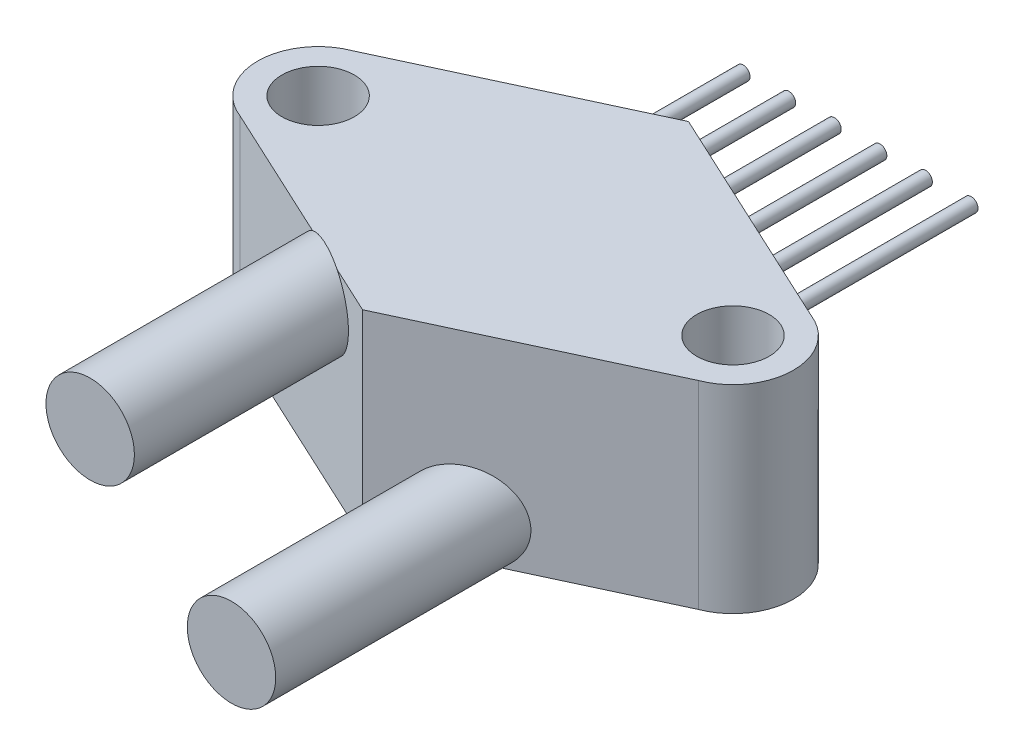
ISO-10303-21;
HEADER;
FILE_DESCRIPTION(('STEP AP214'),'2;1');
FILE_NAME('part.step','',(''),(''),'','','');
FILE_SCHEMA(('AUTOMOTIVE_DESIGN { 1 0 10303 214 1 1 1 1 }'));
ENDSEC;
DATA;
#1=APPLICATION_CONTEXT('core data for automotive mechanical design processes');
#2=APPLICATION_PROTOCOL_DEFINITION('international standard','automotive_design',2000,#1);
#3=PRODUCT_CONTEXT('',#1,'mechanical');
#4=PRODUCT('Part','Part','',(#3));
#5=PRODUCT_RELATED_PRODUCT_CATEGORY('part','',(#4));
#6=PRODUCT_DEFINITION_FORMATION('','',#4);
#7=PRODUCT_DEFINITION_CONTEXT('part definition',#1,'design');
#8=PRODUCT_DEFINITION('design','',#6,#7);
#9=PRODUCT_DEFINITION_SHAPE('','',#8);
#10=(LENGTH_UNIT() NAMED_UNIT(*) SI_UNIT(.MILLI.,.METRE.));
#11=(NAMED_UNIT(*) PLANE_ANGLE_UNIT() SI_UNIT($,.RADIAN.));
#12=(NAMED_UNIT(*) SI_UNIT($,.STERADIAN.) SOLID_ANGLE_UNIT());
#13=UNCERTAINTY_MEASURE_WITH_UNIT(LENGTH_MEASURE(1.E-05),#10,'distance_accuracy_value','');
#14=(GEOMETRIC_REPRESENTATION_CONTEXT(3) GLOBAL_UNCERTAINTY_ASSIGNED_CONTEXT((#13)) GLOBAL_UNIT_ASSIGNED_CONTEXT((#10,
#11,#12)) REPRESENTATION_CONTEXT('',''));
#15=CARTESIAN_POINT('',(0.,0.,0.));
#16=DIRECTION('',(0.,0.,1.));
#17=DIRECTION('',(1.,0.,0.));
#18=AXIS2_PLACEMENT_3D('',#15,#16,#17);
#19=CARTESIAN_POINT('',(0.,11.049,-9.0805));
#20=DIRECTION('',(-0.421848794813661,0.,0.906666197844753));
#21=DIRECTION('',(0.906666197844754,0.,0.421848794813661));
#22=AXIS2_PLACEMENT_3D('',#19,#20,#21);
#23=PLANE('',#22);
#24=CARTESIAN_POINT('',(3.81,5.5245,-7.30780359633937));
#25=DIRECTION('',(-0.421848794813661,0.,0.906666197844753));
#26=DIRECTION('',(-0.906666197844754,0.,-0.421848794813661));
#27=AXIS2_PLACEMENT_3D('',#24,#25,#26);
#28=ELLIPSE('',#27,0.420220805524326,0.381000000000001);
#29=CARTESIAN_POINT('',(3.429,5.5245,-7.48507323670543));
#30=VERTEX_POINT('',#29);
#31=EDGE_CURVE('E37',#30,#30,#28,.F.);
#32=ORIENTED_EDGE('',*,*,#31,.F.);
#33=EDGE_LOOP('',(#32));
#34=FACE_BOUND('',#33,.T.);
#35=DIRECTION('',(-0.906666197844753,0.,-0.421848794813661));
#36=VECTOR('',#35,1.);
#37=CARTESIAN_POINT('',(0.,0.,-9.0805));
#38=LINE('',#37,#36);
#39=CARTESIAN_POINT('',(12.7654847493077,0.,-3.14104359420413));
#40=VERTEX_POINT('',#39);
#41=CARTESIAN_POINT('',(0.,0.,-9.0805));
#42=VERTEX_POINT('',#41);
#43=EDGE_CURVE('E145',#40,#42,#38,.T.);
#44=ORIENTED_EDGE('',*,*,#43,.T.);
#45=DIRECTION('',(0.,-1.,0.));
#46=VECTOR('',#45,1.);
#47=CARTESIAN_POINT('',(0.,11.049,-9.0805));
#48=LINE('',#47,#46);
#49=CARTESIAN_POINT('',(0.,11.049,-9.0805));
#50=VERTEX_POINT('',#49);
#51=EDGE_CURVE('E182',#50,#42,#48,.T.);
#52=ORIENTED_EDGE('',*,*,#51,.F.);
#53=DIRECTION('',(-0.906666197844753,0.,-0.421848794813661));
#54=VECTOR('',#53,1.);
#55=CARTESIAN_POINT('',(0.,11.049,-9.0805));
#56=LINE('',#55,#54);
#57=CARTESIAN_POINT('',(12.7654847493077,11.049,-3.14104359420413));
#58=VERTEX_POINT('',#57);
#59=EDGE_CURVE('E160',#58,#50,#56,.T.);
#60=ORIENTED_EDGE('',*,*,#59,.F.);
#61=DIRECTION('',(0.,-1.,0.));
#62=VECTOR('',#61,1.);
#63=CARTESIAN_POINT('',(12.7654847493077,11.049,-3.14104359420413));
#64=LINE('',#63,#62);
#65=EDGE_CURVE('E169',#58,#40,#64,.T.);
#66=ORIENTED_EDGE('',*,*,#65,.T.);
#67=EDGE_LOOP('',(#44,#52,#60,#66));
#68=FACE_BOUND('',#67,.T.);
#69=CARTESIAN_POINT('',(6.35,5.5245,-6.12600599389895));
#70=DIRECTION('',(-0.421848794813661,0.,0.906666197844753));
#71=DIRECTION('',(-0.906666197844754,0.,-0.421848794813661));
#72=AXIS2_PLACEMENT_3D('',#69,#70,#71);
#73=ELLIPSE('',#72,0.420220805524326,0.381000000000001);
#74=CARTESIAN_POINT('',(5.969,5.5245,-6.30327563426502));
#75=VERTEX_POINT('',#74);
#76=EDGE_CURVE('E194',#75,#75,#73,.F.);
#77=ORIENTED_EDGE('',*,*,#76,.F.);
#78=EDGE_LOOP('',(#77));
#79=FACE_BOUND('',#78,.T.);
#80=CARTESIAN_POINT('',(1.27,5.5245,-8.48960119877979));
#81=DIRECTION('',(-0.421848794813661,0.,0.906666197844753));
#82=DIRECTION('',(-0.906666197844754,0.,-0.421848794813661));
#83=AXIS2_PLACEMENT_3D('',#80,#81,#82);
#84=ELLIPSE('',#83,0.420220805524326,0.381);
#85=CARTESIAN_POINT('',(0.889000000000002,5.5245,-8.66687083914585));
#86=VERTEX_POINT('',#85);
#87=EDGE_CURVE('E11',#86,#86,#84,.F.);
#88=ORIENTED_EDGE('',*,*,#87,.F.);
#89=EDGE_LOOP('',(#88));
#90=FACE_BOUND('',#89,.T.);
#91=ADVANCED_FACE('F30',(#34,#68,#79,#90),#23,.F.);
#92=CARTESIAN_POINT('',(0.,11.049,-9.0805));
#93=DIRECTION('',(0.421848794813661,0.,0.906666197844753));
#94=DIRECTION('',(0.906666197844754,0.,-0.421848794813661));
#95=AXIS2_PLACEMENT_3D('',#92,#93,#94);
#96=PLANE('',#95);
#97=CARTESIAN_POINT('',(-3.81,5.5245,-7.30780359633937));
#98=DIRECTION('',(0.421848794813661,0.,0.906666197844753));
#99=DIRECTION('',(0.906666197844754,0.,-0.421848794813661));
#100=AXIS2_PLACEMENT_3D('',#97,#98,#99);
#101=ELLIPSE('',#100,0.420220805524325,0.381);
#102=CARTESIAN_POINT('',(-3.429,5.5245,-7.48507323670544));
#103=VERTEX_POINT('',#102);
#104=EDGE_CURVE('E188',#103,#103,#101,.F.);
#105=ORIENTED_EDGE('',*,*,#104,.F.);
#106=EDGE_LOOP('',(#105));
#107=FACE_BOUND('',#106,.T.);
#108=DIRECTION('',(-0.906666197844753,0.,0.421848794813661));
#109=VECTOR('',#108,1.);
#110=CARTESIAN_POINT('',(0.,0.,-9.0805));
#111=LINE('',#110,#109);
#112=CARTESIAN_POINT('',(-12.7654847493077,0.,-3.14104359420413));
#113=VERTEX_POINT('',#112);
#114=EDGE_CURVE('E148',#42,#113,#111,.T.);
#115=ORIENTED_EDGE('',*,*,#114,.T.);
#116=DIRECTION('',(0.,-1.,0.));
#117=VECTOR('',#116,1.);
#118=CARTESIAN_POINT('',(-12.7654847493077,11.049,-3.14104359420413));
#119=LINE('',#118,#117);
#120=CARTESIAN_POINT('',(-12.7654847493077,11.049,-3.14104359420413));
#121=VERTEX_POINT('',#120);
#122=EDGE_CURVE('E179',#121,#113,#119,.T.);
#123=ORIENTED_EDGE('',*,*,#122,.F.);
#124=DIRECTION('',(-0.906666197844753,0.,0.421848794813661));
#125=VECTOR('',#124,1.);
#126=CARTESIAN_POINT('',(0.,11.049,-9.0805));
#127=LINE('',#126,#125);
#128=EDGE_CURVE('E162',#50,#121,#127,.T.);
#129=ORIENTED_EDGE('',*,*,#128,.F.);
#130=ORIENTED_EDGE('',*,*,#51,.T.);
#131=EDGE_LOOP('',(#115,#123,#129,#130));
#132=FACE_BOUND('',#131,.T.);
#133=CARTESIAN_POINT('',(-1.27,5.5245,-8.48960119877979));
#134=DIRECTION('',(0.421848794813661,0.,0.906666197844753));
#135=DIRECTION('',(0.906666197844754,0.,-0.421848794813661));
#136=AXIS2_PLACEMENT_3D('',#133,#134,#135);
#137=ELLIPSE('',#136,0.420220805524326,0.381);
#138=CARTESIAN_POINT('',(-0.889,5.5245,-8.66687083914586));
#139=VERTEX_POINT('',#138);
#140=EDGE_CURVE('E114',#139,#139,#137,.F.);
#141=ORIENTED_EDGE('',*,*,#140,.F.);
#142=EDGE_LOOP('',(#141));
#143=FACE_BOUND('',#142,.T.);
#144=CARTESIAN_POINT('',(-6.35,5.5245,-6.12600599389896));
#145=DIRECTION('',(0.421848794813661,0.,0.906666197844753));
#146=DIRECTION('',(0.906666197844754,0.,-0.421848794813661));
#147=AXIS2_PLACEMENT_3D('',#144,#145,#146);
#148=ELLIPSE('',#147,0.420220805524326,0.381000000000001);
#149=CARTESIAN_POINT('',(-5.969,5.5245,-6.30327563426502));
#150=VERTEX_POINT('',#149);
#151=EDGE_CURVE('E191',#150,#150,#148,.F.);
#152=ORIENTED_EDGE('',*,*,#151,.F.);
#153=EDGE_LOOP('',(#152));
#154=FACE_BOUND('',#153,.T.);
#155=ADVANCED_FACE('F203',(#107,#132,#143,#154),#96,.F.);
#156=CARTESIAN_POINT('',(0.,11.049,9.0805));
#157=DIRECTION('',(0.421848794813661,0.,-0.906666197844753));
#158=DIRECTION('',(-0.906666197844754,0.,-0.421848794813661));
#159=AXIS2_PLACEMENT_3D('',#156,#157,#158);
#160=PLANE('',#159);
#161=CARTESIAN_POINT('',(-3.937,8.9408,7.24871371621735));
#162=DIRECTION('',(0.421848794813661,0.,-0.906666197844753));
#163=DIRECTION('',(-0.906666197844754,0.,-0.421848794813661));
#164=AXIS2_PLACEMENT_3D('',#161,#162,#163);
#165=ELLIPSE('',#164,2.71742787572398,2.4638);
#166=CARTESIAN_POINT('',(-5.21206988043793,11.049,6.65545602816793));
#167=VERTEX_POINT('',#166);
#168=CARTESIAN_POINT('',(-2.66193011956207,11.049,7.84197140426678));
#169=VERTEX_POINT('',#168);
#170=EDGE_CURVE('E44',#167,#169,#165,.F.);
#171=ORIENTED_EDGE('',*,*,#170,.F.);
#172=DIRECTION('',(0.906666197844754,0.,0.421848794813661));
#173=VECTOR('',#172,1.);
#174=CARTESIAN_POINT('',(0.,11.049,9.0805));
#175=LINE('',#174,#173);
#176=CARTESIAN_POINT('',(-12.7654847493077,11.049,3.14104359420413));
#177=VERTEX_POINT('',#176);
#178=EDGE_CURVE('E101',#177,#167,#175,.T.);
#179=ORIENTED_EDGE('',*,*,#178,.F.);
#180=DIRECTION('',(0.,-1.,0.));
#181=VECTOR('',#180,1.);
#182=CARTESIAN_POINT('',(-12.7654847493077,11.049,3.14104359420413));
#183=LINE('',#182,#181);
#184=CARTESIAN_POINT('',(-12.7654847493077,0.,3.14104359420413));
#185=VERTEX_POINT('',#184);
#186=EDGE_CURVE('E176',#177,#185,#183,.T.);
#187=ORIENTED_EDGE('',*,*,#186,.T.);
#188=DIRECTION('',(0.906666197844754,0.,0.421848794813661));
#189=VECTOR('',#188,1.);
#190=CARTESIAN_POINT('',(0.,0.,9.0805));
#191=LINE('',#190,#189);
#192=CARTESIAN_POINT('',(0.,0.,9.0805));
#193=VERTEX_POINT('',#192);
#194=EDGE_CURVE('E152',#185,#193,#191,.T.);
#195=ORIENTED_EDGE('',*,*,#194,.T.);
#196=DIRECTION('',(0.,-1.,0.));
#197=VECTOR('',#196,1.);
#198=CARTESIAN_POINT('',(0.,11.049,9.0805));
#199=LINE('',#198,#197);
#200=CARTESIAN_POINT('',(0.,11.049,9.0805));
#201=VERTEX_POINT('',#200);
#202=EDGE_CURVE('E108',#201,#193,#199,.T.);
#203=ORIENTED_EDGE('',*,*,#202,.F.);
#204=EDGE_CURVE('E99',#169,#201,#175,.T.);
#205=ORIENTED_EDGE('',*,*,#204,.F.);
#206=EDGE_LOOP('',(#171,#179,#187,#195,#203,#205));
#207=FACE_BOUND('',#206,.T.);
#208=ADVANCED_FACE('F106',(#207),#160,.F.);
#209=CARTESIAN_POINT('',(0.,11.049,9.0805));
#210=DIRECTION('',(-0.421848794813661,0.,-0.906666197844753));
#211=DIRECTION('',(-0.906666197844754,0.,0.421848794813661));
#212=AXIS2_PLACEMENT_3D('',#209,#210,#211);
#213=PLANE('',#212);
#214=CARTESIAN_POINT('',(3.937,2.1082,7.24871371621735));
#215=DIRECTION('',(-0.421848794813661,0.,-0.906666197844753));
#216=DIRECTION('',(0.906666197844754,0.,-0.421848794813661));
#217=AXIS2_PLACEMENT_3D('',#214,#215,#216);
#218=ELLIPSE('',#217,2.71742787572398,2.4638);
#219=CARTESIAN_POINT('',(5.21206988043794,0.,6.65545602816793));
#220=VERTEX_POINT('',#219);
#221=CARTESIAN_POINT('',(2.66193011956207,0.,7.84197140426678));
#222=VERTEX_POINT('',#221);
#223=EDGE_CURVE('E52',#220,#222,#218,.F.);
#224=ORIENTED_EDGE('',*,*,#223,.F.);
#225=DIRECTION('',(0.906666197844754,0.,-0.421848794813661));
#226=VECTOR('',#225,1.);
#227=CARTESIAN_POINT('',(0.,0.,9.0805));
#228=LINE('',#227,#226);
#229=CARTESIAN_POINT('',(12.7654847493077,0.,3.14104359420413));
#230=VERTEX_POINT('',#229);
#231=EDGE_CURVE('E154',#220,#230,#228,.T.);
#232=ORIENTED_EDGE('',*,*,#231,.T.);
#233=DIRECTION('',(0.,-1.,0.));
#234=VECTOR('',#233,1.);
#235=CARTESIAN_POINT('',(12.7654847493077,11.049,3.14104359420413));
#236=LINE('',#235,#234);
#237=CARTESIAN_POINT('',(12.7654847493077,11.049,3.14104359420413));
#238=VERTEX_POINT('',#237);
#239=EDGE_CURVE('E172',#238,#230,#236,.T.);
#240=ORIENTED_EDGE('',*,*,#239,.F.);
#241=DIRECTION('',(0.906666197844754,0.,-0.421848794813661));
#242=VECTOR('',#241,1.);
#243=CARTESIAN_POINT('',(0.,11.049,9.0805));
#244=LINE('',#243,#242);
#245=EDGE_CURVE('E165',#201,#238,#244,.T.);
#246=ORIENTED_EDGE('',*,*,#245,.F.);
#247=ORIENTED_EDGE('',*,*,#202,.T.);
#248=EDGE_CURVE('E155',#193,#222,#228,.T.);
#249=ORIENTED_EDGE('',*,*,#248,.T.);
#250=EDGE_LOOP('',(#224,#232,#240,#246,#247,#249));
#251=FACE_BOUND('',#250,.T.);
#252=ADVANCED_FACE('F299',(#251),#213,.F.);
#253=CARTESIAN_POINT('',(11.557,11.049,0.));
#254=DIRECTION('',(0.,1.,0.));
#255=DIRECTION('',(0.,0.,1.));
#256=AXIS2_PLACEMENT_3D('',#253,#254,#255);
#257=PLANE('',#256);
#258=CARTESIAN_POINT('',(11.557,11.049,0.));
#259=DIRECTION('',(0.,1.,0.));
#260=DIRECTION('',(0.,0.,1.));
#261=AXIS2_PLACEMENT_3D('',#258,#259,#260);
#262=CIRCLE('',#261,2.0193);
#263=CARTESIAN_POINT('',(11.557,11.049,2.0193));
#264=VERTEX_POINT('',#263);
#265=EDGE_CURVE('E142',#264,#264,#262,.T.);
#266=ORIENTED_EDGE('',*,*,#265,.F.);
#267=EDGE_LOOP('',(#266));
#268=FACE_BOUND('',#267,.T.);
#269=ORIENTED_EDGE('',*,*,#59,.T.);
#270=ORIENTED_EDGE('',*,*,#128,.T.);
#271=CARTESIAN_POINT('',(-11.557,11.049,0.));
#272=DIRECTION('',(0.,1.,0.));
#273=DIRECTION('',(0.,0.,-1.));
#274=AXIS2_PLACEMENT_3D('',#271,#272,#273);
#275=CIRCLE('',#274,3.3655);
#276=EDGE_CURVE('E110',#121,#177,#275,.T.);
#277=ORIENTED_EDGE('',*,*,#276,.T.);
#278=ORIENTED_EDGE('',*,*,#178,.T.);
#279=EDGE_CURVE('E95',#167,#169,#175,.T.);
#280=ORIENTED_EDGE('',*,*,#279,.T.);
#281=ORIENTED_EDGE('',*,*,#204,.T.);
#282=ORIENTED_EDGE('',*,*,#245,.T.);
#283=CARTESIAN_POINT('',(11.557,11.049,0.));
#284=DIRECTION('',(0.,1.,0.));
#285=DIRECTION('',(0.,0.,1.));
#286=AXIS2_PLACEMENT_3D('',#283,#284,#285);
#287=CIRCLE('',#286,3.3655);
#288=EDGE_CURVE('E167',#238,#58,#287,.T.);
#289=ORIENTED_EDGE('',*,*,#288,.T.);
#290=EDGE_LOOP('',(#269,#270,#277,#278,#280,#281,#282,#289));
#291=FACE_BOUND('',#290,.T.);
#292=CARTESIAN_POINT('',(-11.557,11.049,0.));
#293=DIRECTION('',(0.,1.,0.));
#294=DIRECTION('',(0.,0.,-1.));
#295=AXIS2_PLACEMENT_3D('',#292,#293,#294);
#296=CIRCLE('',#295,2.0193);
#297=CARTESIAN_POINT('',(-11.557,11.049,-2.0193));
#298=VERTEX_POINT('',#297);
#299=EDGE_CURVE('E136',#298,#298,#296,.T.);
#300=ORIENTED_EDGE('',*,*,#299,.F.);
#301=EDGE_LOOP('',(#300));
#302=FACE_BOUND('',#301,.T.);
#303=ADVANCED_FACE('F97',(#268,#291,#302),#257,.T.);
#304=CARTESIAN_POINT('',(11.557,0.,0.));
#305=DIRECTION('',(0.,1.,0.));
#306=DIRECTION('',(0.,0.,1.));
#307=AXIS2_PLACEMENT_3D('',#304,#305,#306);
#308=PLANE('',#307);
#309=CARTESIAN_POINT('',(11.557,0.,0.));
#310=DIRECTION('',(0.,1.,0.));
#311=DIRECTION('',(0.,0.,1.));
#312=AXIS2_PLACEMENT_3D('',#309,#310,#311);
#313=CIRCLE('',#312,2.0193);
#314=CARTESIAN_POINT('',(11.557,0.,2.0193));
#315=VERTEX_POINT('',#314);
#316=EDGE_CURVE('E139',#315,#315,#313,.T.);
#317=ORIENTED_EDGE('',*,*,#316,.T.);
#318=EDGE_LOOP('',(#317));
#319=FACE_BOUND('',#318,.T.);
#320=ORIENTED_EDGE('',*,*,#43,.F.);
#321=CARTESIAN_POINT('',(11.557,0.,0.));
#322=DIRECTION('',(0.,1.,0.));
#323=DIRECTION('',(0.,0.,1.));
#324=AXIS2_PLACEMENT_3D('',#321,#322,#323);
#325=CIRCLE('',#324,3.3655);
#326=EDGE_CURVE('E157',#230,#40,#325,.T.);
#327=ORIENTED_EDGE('',*,*,#326,.F.);
#328=ORIENTED_EDGE('',*,*,#231,.F.);
#329=EDGE_CURVE('E158',#222,#220,#228,.T.);
#330=ORIENTED_EDGE('',*,*,#329,.F.);
#331=ORIENTED_EDGE('',*,*,#248,.F.);
#332=ORIENTED_EDGE('',*,*,#194,.F.);
#333=CARTESIAN_POINT('',(-11.557,0.,0.));
#334=DIRECTION('',(0.,1.,0.));
#335=DIRECTION('',(0.,0.,-1.));
#336=AXIS2_PLACEMENT_3D('',#333,#334,#335);
#337=CIRCLE('',#336,3.3655);
#338=EDGE_CURVE('E150',#113,#185,#337,.T.);
#339=ORIENTED_EDGE('',*,*,#338,.F.);
#340=ORIENTED_EDGE('',*,*,#114,.F.);
#341=EDGE_LOOP('',(#320,#327,#328,#330,#331,#332,#339,#340));
#342=FACE_BOUND('',#341,.T.);
#343=CARTESIAN_POINT('',(-11.557,0.,0.));
#344=DIRECTION('',(0.,1.,0.));
#345=DIRECTION('',(0.,0.,-1.));
#346=AXIS2_PLACEMENT_3D('',#343,#344,#345);
#347=CIRCLE('',#346,2.0193);
#348=CARTESIAN_POINT('',(-11.557,0.,-2.0193));
#349=VERTEX_POINT('',#348);
#350=EDGE_CURVE('E133',#349,#349,#347,.T.);
#351=ORIENTED_EDGE('',*,*,#350,.T.);
#352=EDGE_LOOP('',(#351));
#353=FACE_BOUND('',#352,.T.);
#354=ADVANCED_FACE('F292',(#319,#342,#353),#308,.F.);
#355=CARTESIAN_POINT('',(-11.557,11.049,0.));
#356=DIRECTION('',(0.,-1.,0.));
#357=DIRECTION('',(0.,0.,-1.));
#358=AXIS2_PLACEMENT_3D('',#355,#356,#357);
#359=CYLINDRICAL_SURFACE('',#358,3.3655);
#360=ORIENTED_EDGE('',*,*,#338,.T.);
#361=ORIENTED_EDGE('',*,*,#186,.F.);
#362=ORIENTED_EDGE('',*,*,#276,.F.);
#363=ORIENTED_EDGE('',*,*,#122,.T.);
#364=EDGE_LOOP('',(#360,#361,#362,#363));
#365=FACE_BOUND('',#364,.T.);
#366=ADVANCED_FACE('F295',(#365),#359,.T.);
#367=CARTESIAN_POINT('',(11.557,11.049,0.));
#368=DIRECTION('',(0.,-1.,0.));
#369=DIRECTION('',(0.,0.,-1.));
#370=AXIS2_PLACEMENT_3D('',#367,#368,#369);
#371=CYLINDRICAL_SURFACE('',#370,3.3655);
#372=ORIENTED_EDGE('',*,*,#326,.T.);
#373=ORIENTED_EDGE('',*,*,#65,.F.);
#374=ORIENTED_EDGE('',*,*,#288,.F.);
#375=ORIENTED_EDGE('',*,*,#239,.T.);
#376=EDGE_LOOP('',(#372,#373,#374,#375));
#377=FACE_BOUND('',#376,.T.);
#378=ADVANCED_FACE('F290',(#377),#371,.T.);
#379=CARTESIAN_POINT('',(11.557,11.049,0.));
#380=DIRECTION('',(0.,-1.,0.));
#381=DIRECTION('',(0.,0.,-1.));
#382=AXIS2_PLACEMENT_3D('',#379,#380,#381);
#383=CYLINDRICAL_SURFACE('',#382,2.0193);
#384=ORIENTED_EDGE('',*,*,#265,.T.);
#385=EDGE_LOOP('',(#384));
#386=FACE_BOUND('',#385,.T.);
#387=ORIENTED_EDGE('',*,*,#316,.F.);
#388=EDGE_LOOP('',(#387));
#389=FACE_BOUND('',#388,.T.);
#390=ADVANCED_FACE('F286',(#386,#389),#383,.F.);
#391=CARTESIAN_POINT('',(-11.557,11.049,0.));
#392=DIRECTION('',(0.,-1.,0.));
#393=DIRECTION('',(0.,0.,-1.));
#394=AXIS2_PLACEMENT_3D('',#391,#392,#393);
#395=CYLINDRICAL_SURFACE('',#394,2.0193);
#396=ORIENTED_EDGE('',*,*,#299,.T.);
#397=EDGE_LOOP('',(#396));
#398=FACE_BOUND('',#397,.T.);
#399=ORIENTED_EDGE('',*,*,#350,.F.);
#400=EDGE_LOOP('',(#399));
#401=FACE_BOUND('',#400,.T.);
#402=ADVANCED_FACE('F276',(#398,#401),#395,.F.);
#403=CARTESIAN_POINT('',(0.,11.049,9.0805));
#404=DIRECTION('',(-0.421848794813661,0.,-0.906666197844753));
#405=DIRECTION('',(-0.906666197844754,0.,0.421848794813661));
#406=AXIS2_PLACEMENT_3D('',#403,#404,#405);
#407=PLANE('',#406);
#408=ORIENTED_EDGE('',*,*,#329,.T.);
#409=CARTESIAN_POINT('',(3.937,2.1082,7.24871371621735));
#410=DIRECTION('',(-0.421848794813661,0.,-0.906666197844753));
#411=DIRECTION('',(-0.906666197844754,0.,0.421848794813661));
#412=AXIS2_PLACEMENT_3D('',#409,#410,#411);
#413=ELLIPSE('',#412,2.71742787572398,2.4638);
#414=EDGE_CURVE('E121',#222,#220,#413,.F.);
#415=ORIENTED_EDGE('',*,*,#414,.F.);
#416=EDGE_LOOP('',(#408,#415));
#417=FACE_BOUND('',#416,.T.);
#418=ADVANCED_FACE('F272',(#417),#407,.T.);
#419=CARTESIAN_POINT('',(3.937,2.1082,20.32));
#420=DIRECTION('',(0.,0.,-1.));
#421=DIRECTION('',(-1.,0.,0.));
#422=AXIS2_PLACEMENT_3D('',#419,#420,#421);
#423=CYLINDRICAL_SURFACE('',#422,2.4638);
#424=CARTESIAN_POINT('',(3.937,2.1082,20.32));
#425=DIRECTION('',(0.,0.,1.));
#426=DIRECTION('',(1.,0.,0.));
#427=AXIS2_PLACEMENT_3D('',#424,#425,#426);
#428=CIRCLE('',#427,2.4638);
#429=CARTESIAN_POINT('',(6.4008,2.1082,20.32));
#430=VERTEX_POINT('',#429);
#431=EDGE_CURVE('E130',#430,#430,#428,.T.);
#432=ORIENTED_EDGE('',*,*,#431,.F.);
#433=EDGE_LOOP('',(#432));
#434=FACE_BOUND('',#433,.T.);
#435=ORIENTED_EDGE('',*,*,#414,.T.);
#436=ORIENTED_EDGE('',*,*,#223,.T.);
#437=EDGE_LOOP('',(#435,#436));
#438=FACE_BOUND('',#437,.T.);
#439=ADVANCED_FACE('F275',(#434,#438),#423,.T.);
#440=CARTESIAN_POINT('',(3.937,2.1082,20.32));
#441=DIRECTION('',(0.,0.,1.));
#442=DIRECTION('',(1.,0.,0.));
#443=AXIS2_PLACEMENT_3D('',#440,#441,#442);
#444=PLANE('',#443);
#445=ORIENTED_EDGE('',*,*,#431,.T.);
#446=EDGE_LOOP('',(#445));
#447=FACE_BOUND('',#446,.T.);
#448=ADVANCED_FACE('F270',(#447),#444,.T.);
#449=CARTESIAN_POINT('',(-3.937,8.9408,20.32));
#450=DIRECTION('',(0.,0.,-1.));
#451=DIRECTION('',(-1.,0.,0.));
#452=AXIS2_PLACEMENT_3D('',#449,#450,#451);
#453=CYLINDRICAL_SURFACE('',#452,2.4638);
#454=CARTESIAN_POINT('',(-3.937,8.9408,20.32));
#455=DIRECTION('',(0.,0.,1.));
#456=DIRECTION('',(1.,0.,0.));
#457=AXIS2_PLACEMENT_3D('',#454,#455,#456);
#458=CIRCLE('',#457,2.4638);
#459=CARTESIAN_POINT('',(-1.4732,8.9408,20.32));
#460=VERTEX_POINT('',#459);
#461=EDGE_CURVE('E117',#460,#460,#458,.T.);
#462=ORIENTED_EDGE('',*,*,#461,.F.);
#463=EDGE_LOOP('',(#462));
#464=FACE_BOUND('',#463,.T.);
#465=CARTESIAN_POINT('',(-3.937,8.9408,7.24871371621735));
#466=DIRECTION('',(0.421848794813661,0.,-0.906666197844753));
#467=DIRECTION('',(0.906666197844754,0.,0.421848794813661));
#468=AXIS2_PLACEMENT_3D('',#465,#466,#467);
#469=ELLIPSE('',#468,2.71742787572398,2.4638);
#470=EDGE_CURVE('E113',#169,#167,#469,.F.);
#471=ORIENTED_EDGE('',*,*,#470,.T.);
#472=ORIENTED_EDGE('',*,*,#170,.T.);
#473=EDGE_LOOP('',(#471,#472));
#474=FACE_BOUND('',#473,.T.);
#475=ADVANCED_FACE('F112',(#464,#474),#453,.T.);
#476=CARTESIAN_POINT('',(-3.937,8.9408,20.32));
#477=DIRECTION('',(0.,0.,1.));
#478=DIRECTION('',(1.,0.,0.));
#479=AXIS2_PLACEMENT_3D('',#476,#477,#478);
#480=PLANE('',#479);
#481=ORIENTED_EDGE('',*,*,#461,.T.);
#482=EDGE_LOOP('',(#481));
#483=FACE_BOUND('',#482,.T.);
#484=ADVANCED_FACE('F264',(#483),#480,.T.);
#485=CARTESIAN_POINT('',(0.,11.049,9.0805));
#486=DIRECTION('',(0.421848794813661,0.,-0.906666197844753));
#487=DIRECTION('',(-0.906666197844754,0.,-0.421848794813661));
#488=AXIS2_PLACEMENT_3D('',#485,#486,#487);
#489=PLANE('',#488);
#490=ORIENTED_EDGE('',*,*,#470,.F.);
#491=ORIENTED_EDGE('',*,*,#279,.F.);
#492=EDGE_LOOP('',(#490,#491));
#493=FACE_BOUND('',#492,.T.);
#494=ADVANCED_FACE('F116',(#493),#489,.T.);
#495=CARTESIAN_POINT('',(-1.27,5.5245,2.032));
#496=DIRECTION('',(0.,0.,-1.));
#497=DIRECTION('',(-1.,0.,0.));
#498=AXIS2_PLACEMENT_3D('',#495,#496,#497);
#499=CYLINDRICAL_SURFACE('',#498,0.381);
#500=CARTESIAN_POINT('',(-1.27,5.5245,-18.4785));
#501=DIRECTION('',(0.,0.,1.));
#502=DIRECTION('',(1.,0.,0.));
#503=AXIS2_PLACEMENT_3D('',#500,#501,#502);
#504=CIRCLE('',#503,0.381);
#505=CARTESIAN_POINT('',(-0.889,5.5245,-18.4785));
#506=VERTEX_POINT('',#505);
#507=EDGE_CURVE('E118',#506,#506,#504,.T.);
#508=ORIENTED_EDGE('',*,*,#507,.T.);
#509=EDGE_LOOP('',(#508));
#510=FACE_BOUND('',#509,.T.);
#511=ORIENTED_EDGE('',*,*,#140,.T.);
#512=EDGE_LOOP('',(#511));
#513=FACE_BOUND('',#512,.T.);
#514=ADVANCED_FACE('F257',(#510,#513),#499,.T.);
#515=CARTESIAN_POINT('',(-1.27,5.5245,-18.4785));
#516=DIRECTION('',(0.,0.,1.));
#517=DIRECTION('',(1.,0.,0.));
#518=AXIS2_PLACEMENT_3D('',#515,#516,#517);
#519=PLANE('',#518);
#520=ORIENTED_EDGE('',*,*,#507,.F.);
#521=EDGE_LOOP('',(#520));
#522=FACE_BOUND('',#521,.T.);
#523=ADVANCED_FACE('F253',(#522),#519,.F.);
#524=CARTESIAN_POINT('',(-3.81,5.5245,2.032));
#525=DIRECTION('',(0.,0.,-1.));
#526=DIRECTION('',(-1.,0.,0.));
#527=AXIS2_PLACEMENT_3D('',#524,#525,#526);
#528=CYLINDRICAL_SURFACE('',#527,0.381);
#529=CARTESIAN_POINT('',(-3.81,5.5245,-18.4785));
#530=DIRECTION('',(0.,0.,1.));
#531=DIRECTION('',(1.,0.,0.));
#532=AXIS2_PLACEMENT_3D('',#529,#530,#531);
#533=CIRCLE('',#532,0.381);
#534=CARTESIAN_POINT('',(-3.429,5.5245,-18.4785));
#535=VERTEX_POINT('',#534);
#536=EDGE_CURVE('E124',#535,#535,#533,.T.);
#537=ORIENTED_EDGE('',*,*,#536,.T.);
#538=EDGE_LOOP('',(#537));
#539=FACE_BOUND('',#538,.T.);
#540=ORIENTED_EDGE('',*,*,#104,.T.);
#541=EDGE_LOOP('',(#540));
#542=FACE_BOUND('',#541,.T.);
#543=ADVANCED_FACE('F249',(#539,#542),#528,.T.);
#544=CARTESIAN_POINT('',(-3.81,5.5245,-18.4785));
#545=DIRECTION('',(0.,0.,1.));
#546=DIRECTION('',(1.,0.,0.));
#547=AXIS2_PLACEMENT_3D('',#544,#545,#546);
#548=PLANE('',#547);
#549=ORIENTED_EDGE('',*,*,#536,.F.);
#550=EDGE_LOOP('',(#549));
#551=FACE_BOUND('',#550,.T.);
#552=ADVANCED_FACE('F245',(#551),#548,.F.);
#553=CARTESIAN_POINT('',(-6.35,5.5245,2.032));
#554=DIRECTION('',(0.,0.,-1.));
#555=DIRECTION('',(-1.,0.,0.));
#556=AXIS2_PLACEMENT_3D('',#553,#554,#555);
#557=CYLINDRICAL_SURFACE('',#556,0.381000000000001);
#558=CARTESIAN_POINT('',(-6.35,5.5245,-18.4785));
#559=DIRECTION('',(0.,0.,1.));
#560=DIRECTION('',(1.,0.,0.));
#561=AXIS2_PLACEMENT_3D('',#558,#559,#560);
#562=CIRCLE('',#561,0.381000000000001);
#563=CARTESIAN_POINT('',(-5.969,5.5245,-18.4785));
#564=VERTEX_POINT('',#563);
#565=EDGE_CURVE('E515',#564,#564,#562,.T.);
#566=ORIENTED_EDGE('',*,*,#565,.T.);
#567=EDGE_LOOP('',(#566));
#568=FACE_BOUND('',#567,.T.);
#569=ORIENTED_EDGE('',*,*,#151,.T.);
#570=EDGE_LOOP('',(#569));
#571=FACE_BOUND('',#570,.T.);
#572=ADVANCED_FACE('F241',(#568,#571),#557,.T.);
#573=CARTESIAN_POINT('',(-6.35,5.5245,-18.4785));
#574=DIRECTION('',(0.,0.,1.));
#575=DIRECTION('',(1.,0.,0.));
#576=AXIS2_PLACEMENT_3D('',#573,#574,#575);
#577=PLANE('',#576);
#578=ORIENTED_EDGE('',*,*,#565,.F.);
#579=EDGE_LOOP('',(#578));
#580=FACE_BOUND('',#579,.T.);
#581=ADVANCED_FACE('F237',(#580),#577,.F.);
#582=CARTESIAN_POINT('',(6.35,5.5245,2.032));
#583=DIRECTION('',(0.,0.,-1.));
#584=DIRECTION('',(-1.,0.,0.));
#585=AXIS2_PLACEMENT_3D('',#582,#583,#584);
#586=CYLINDRICAL_SURFACE('',#585,0.381000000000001);
#587=CARTESIAN_POINT('',(6.35,5.5245,-18.4785));
#588=DIRECTION('',(0.,0.,1.));
#589=DIRECTION('',(-1.,0.,0.));
#590=AXIS2_PLACEMENT_3D('',#587,#588,#589);
#591=CIRCLE('',#590,0.381000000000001);
#592=CARTESIAN_POINT('',(5.969,5.5245,-18.4785));
#593=VERTEX_POINT('',#592);
#594=EDGE_CURVE('E517',#593,#593,#591,.T.);
#595=ORIENTED_EDGE('',*,*,#594,.T.);
#596=EDGE_LOOP('',(#595));
#597=FACE_BOUND('',#596,.T.);
#598=ORIENTED_EDGE('',*,*,#76,.T.);
#599=EDGE_LOOP('',(#598));
#600=FACE_BOUND('',#599,.T.);
#601=ADVANCED_FACE('F233',(#597,#600),#586,.T.);
#602=CARTESIAN_POINT('',(6.35,5.5245,-18.4785));
#603=DIRECTION('',(0.,0.,-1.));
#604=DIRECTION('',(-1.,0.,0.));
#605=AXIS2_PLACEMENT_3D('',#602,#603,#604);
#606=PLANE('',#605);
#607=ORIENTED_EDGE('',*,*,#594,.F.);
#608=EDGE_LOOP('',(#607));
#609=FACE_BOUND('',#608,.T.);
#610=ADVANCED_FACE('F229',(#609),#606,.T.);
#611=CARTESIAN_POINT('',(3.81,5.5245,2.032));
#612=DIRECTION('',(0.,0.,-1.));
#613=DIRECTION('',(-1.,0.,0.));
#614=AXIS2_PLACEMENT_3D('',#611,#612,#613);
#615=CYLINDRICAL_SURFACE('',#614,0.381000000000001);
#616=CARTESIAN_POINT('',(3.81,5.5245,-18.4785));
#617=DIRECTION('',(0.,0.,1.));
#618=DIRECTION('',(-1.,0.,0.));
#619=AXIS2_PLACEMENT_3D('',#616,#617,#618);
#620=CIRCLE('',#619,0.381000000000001);
#621=CARTESIAN_POINT('',(3.429,5.5245,-18.4785));
#622=VERTEX_POINT('',#621);
#623=EDGE_CURVE('E522',#622,#622,#620,.T.);
#624=ORIENTED_EDGE('',*,*,#623,.T.);
#625=EDGE_LOOP('',(#624));
#626=FACE_BOUND('',#625,.T.);
#627=ORIENTED_EDGE('',*,*,#31,.T.);
#628=EDGE_LOOP('',(#627));
#629=FACE_BOUND('',#628,.T.);
#630=ADVANCED_FACE('F199',(#626,#629),#615,.T.);
#631=CARTESIAN_POINT('',(3.81,5.5245,-18.4785));
#632=DIRECTION('',(0.,0.,-1.));
#633=DIRECTION('',(-1.,0.,0.));
#634=AXIS2_PLACEMENT_3D('',#631,#632,#633);
#635=PLANE('',#634);
#636=ORIENTED_EDGE('',*,*,#623,.F.);
#637=EDGE_LOOP('',(#636));
#638=FACE_BOUND('',#637,.T.);
#639=ADVANCED_FACE('F214',(#638),#635,.T.);
#640=CARTESIAN_POINT('',(1.27,5.5245,2.032));
#641=DIRECTION('',(0.,0.,-1.));
#642=DIRECTION('',(-1.,0.,0.));
#643=AXIS2_PLACEMENT_3D('',#640,#641,#642);
#644=CYLINDRICAL_SURFACE('',#643,0.381);
#645=CARTESIAN_POINT('',(1.27,5.5245,-18.4785));
#646=DIRECTION('',(0.,0.,1.));
#647=DIRECTION('',(-1.,0.,0.));
#648=AXIS2_PLACEMENT_3D('',#645,#646,#647);
#649=CIRCLE('',#648,0.381);
#650=CARTESIAN_POINT('',(0.889000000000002,5.5245,-18.4785));
#651=VERTEX_POINT('',#650);
#652=EDGE_CURVE('E525',#651,#651,#649,.T.);
#653=ORIENTED_EDGE('',*,*,#652,.T.);
#654=EDGE_LOOP('',(#653));
#655=FACE_BOUND('',#654,.T.);
#656=ORIENTED_EDGE('',*,*,#87,.T.);
#657=EDGE_LOOP('',(#656));
#658=FACE_BOUND('',#657,.T.);
#659=ADVANCED_FACE('F211',(#655,#658),#644,.T.);
#660=CARTESIAN_POINT('',(1.27,5.5245,-18.4785));
#661=DIRECTION('',(0.,0.,-1.));
#662=DIRECTION('',(-1.,0.,0.));
#663=AXIS2_PLACEMENT_3D('',#660,#661,#662);
#664=PLANE('',#663);
#665=ORIENTED_EDGE('',*,*,#652,.F.);
#666=EDGE_LOOP('',(#665));
#667=FACE_BOUND('',#666,.T.);
#668=ADVANCED_FACE('F213',(#667),#664,.T.);
#669=CLOSED_SHELL('',(#91,#155,#208,#252,#303,#354,#366,#378,#390,#402,#418,#439,#448,#475,#484,
#494,#514,#523,#543,#552,#572,#581,#601,#610,#630,#639,#659,#668));
#670=MANIFOLD_SOLID_BREP('B2',#669);
#671=ADVANCED_BREP_SHAPE_REPRESENTATION('',(#18,#670),#14);
#672=SHAPE_DEFINITION_REPRESENTATION(#9,#671);
ENDSEC;
END-ISO-10303-21;
